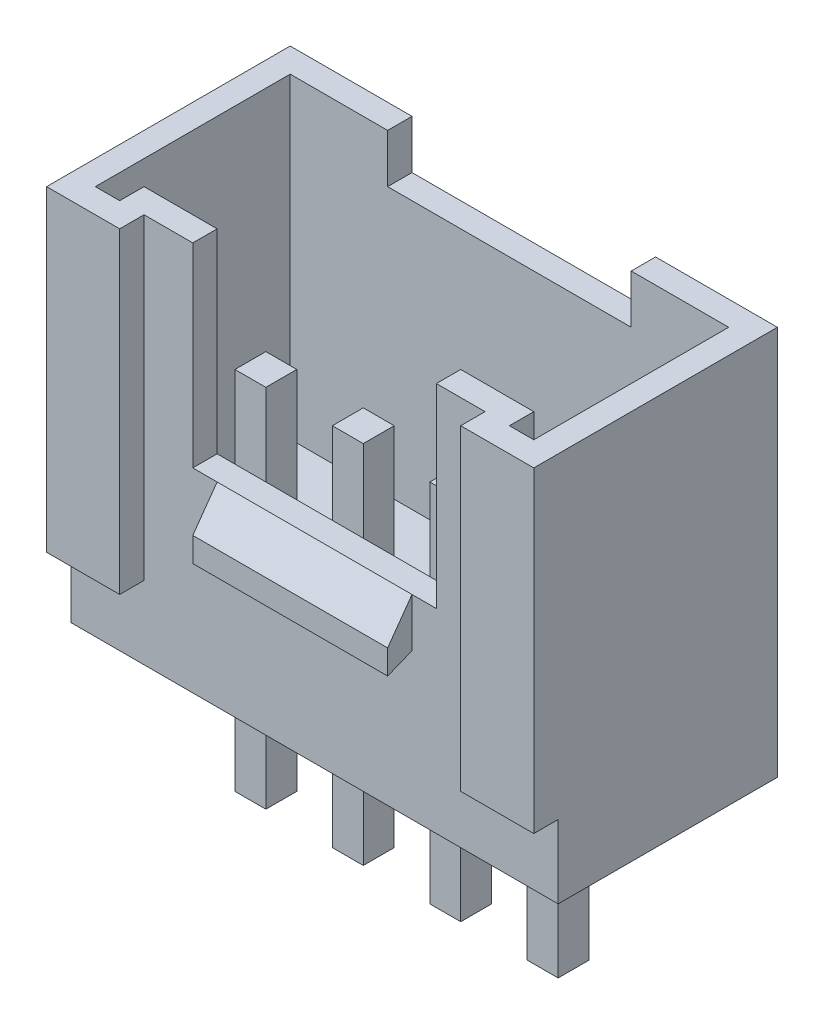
from build123d import *

# Parameters (mm, degrees)
SIDES_DEPTH           = 8
SKETCH2_W             = 5
SKETCH2_H             = 4
FRONT_CUT_DEPTH       = 0.5
BACK_CUT_REACH        = 15.748
SKETCH3_W             = 5
SKETCH3_H             = 1
BASE_DEPTH            = 0.5
PINS_DEPTH            = 4
PINS_DEPTH_BACK       = 3.5
SKETCH4_W             = 0.635
SKETCH4_H             = 0.635
CLIP_DEPTH            = 2
CLIP_DEPTH_BACK       = 2
FRONT_TRIM_DEPTH      = 11.677078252
FRONT_TRIM_DEPTH_BACK = 11.677078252
SKETCH6_W             = 0.5
SKETCH6_H             = 1.5
BOSS_EXTRUDE4_DEPTH   = 1.51


with BuildPart() as part:
    # Sketch1 → Sides (new body)
    with BuildSketch(Plane(origin=(0, 0, 0), x_dir=(1, 0, 0), z_dir=(0, 1, 0))):
        Polygon((8.5, 0), (10, 0), (10, 5), (0, 5), (0, 0), (1.5, 0), (1.5, 0.5), (8.5, 0.5), align=None)
        Polygon((0.5, 4.5), (9.5, 4.5), (9.5, 1.528846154), (9.5, 0.5), (9, 0.5), (9, 1), (1, 1), (1, 0.5), (0.5, 0.5), (0.5, 1.538461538), align=None, mode=Mode.SUBTRACT)
    extrude(amount=SIDES_DEPTH)

    # Sketch2 → Front cut (cut)
    with BuildSketch(Plane.XY.offset(-0.5)):
        with Locations((5, 6)):
            Rectangle(SKETCH2_W, SKETCH2_H)
    extrude(amount=-FRONT_CUT_DEPTH, mode=Mode.SUBTRACT)

    # Sketch3 → Back cut (cut, up to next)
    with BuildSketch(Plane(origin=(0, 0, -5), x_dir=(-1, 0, 0), z_dir=(0, 0, -1)), mode=Mode.PRIVATE) as back_cut_sk1:
        with Locations((-5, 7.5)):
            Rectangle(SKETCH3_W, SKETCH3_H)
    back_cut_tool1 = extrude(back_cut_sk1.sketch, amount=-BACK_CUT_REACH, mode=Mode.PRIVATE) & part.part
    add(back_cut_tool1.solids().sort_by_distance((5, 7.5, -5))[0], mode=Mode.SUBTRACT)

    # Sketch1_2 → Base (add)
    with BuildSketch(Plane(origin=(0, 0, 0), x_dir=(1, 0, 0), z_dir=(0, 1, 0))):
        Polygon((1, 1), (1, 0.5), (0.5, 0.5), (0.5, 1.538461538), (0.5, 4.5), (9.5, 4.5), (9.5, 1.528846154), (9.5, 0.5), (9, 0.5), (9, 1), align=None)
    extrude(amount=BASE_DEPTH)

    # Sketch4 → Pins (add, two sides: drawn at the far end of the back side and taken through both)
    with BuildSketch(Plane(origin=(0, 0.5, 0), x_dir=(1, 0, 0), z_dir=(0, 1, 0)).offset(-PINS_DEPTH_BACK)):
        with Locations((2, 2.5)):
            Rectangle(SKETCH4_W, SKETCH4_H)
        with Locations((4, 2.5)):
            Rectangle(SKETCH4_W, SKETCH4_H)
        with Locations((6, 2.5)):
            Rectangle(SKETCH4_W, SKETCH4_H)
        with Locations((8, 2.5)):
            Rectangle(SKETCH4_W, SKETCH4_H)
    extrude(amount=PINS_DEPTH + PINS_DEPTH_BACK)

    # Sketch5 → Clip (add, two sides: drawn at the far end of the back side and taken through both)
    with BuildSketch(Plane(origin=(5, 0, 0), x_dir=(0, 0, -1), z_dir=(1, 0, 0)).offset(-CLIP_DEPTH_BACK)):
        Polygon((0.5, 4), (0.5, 3), (0, 2.8), (0, 3.3), align=None)
    extrude(amount=CLIP_DEPTH + CLIP_DEPTH_BACK)

    # Sketch6 → Front trim (cut, two sides: drawn at the far end of the back side and taken through both)
    with BuildSketch(Plane(origin=(5, 0, 0), x_dir=(0, 0, -1), z_dir=(1, 0, 0)).offset(-FRONT_TRIM_DEPTH_BACK)):
        with Locations((0.25, 0.75)):
            Rectangle(SKETCH6_W, SKETCH6_H)
    extrude(amount=FRONT_TRIM_DEPTH + FRONT_TRIM_DEPTH_BACK, mode=Mode.SUBTRACT)

    # Sketch1_4 → Boss-Extrude4 (add)
    with BuildSketch(Plane(origin=(0, 0, 0), x_dir=(1, 0, 0), z_dir=(0, 1, 0))):
        Polygon((1, 1), (1, 0.5), (0.5, 0.5), (0.5, 1.538461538), (0.5, 4.5), (9.5, 4.5), (9.5, 1.528846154), (9.5, 0.5), (9, 0.5), (9, 1), align=None)
    extrude(amount=BOSS_EXTRUDE4_DEPTH)


solid = part.part
